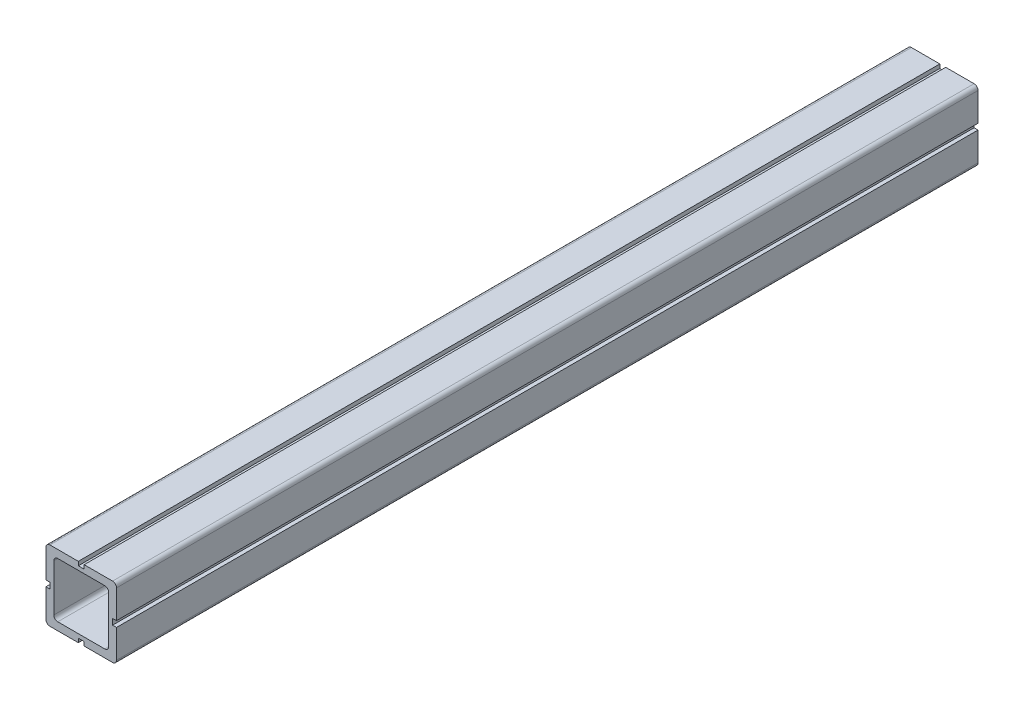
ISO-10303-21;
HEADER;
FILE_DESCRIPTION(('STEP AP214'),'2;1');
FILE_NAME('part.step','',(''),(''),'','','');
FILE_SCHEMA(('AUTOMOTIVE_DESIGN { 1 0 10303 214 1 1 1 1 }'));
ENDSEC;
DATA;
#1=APPLICATION_CONTEXT('core data for automotive mechanical design processes');
#2=APPLICATION_PROTOCOL_DEFINITION('international standard','automotive_design',2000,#1);
#3=PRODUCT_CONTEXT('',#1,'mechanical');
#4=PRODUCT('Part','Part','',(#3));
#5=PRODUCT_RELATED_PRODUCT_CATEGORY('part','',(#4));
#6=PRODUCT_DEFINITION_FORMATION('','',#4);
#7=PRODUCT_DEFINITION_CONTEXT('part definition',#1,'design');
#8=PRODUCT_DEFINITION('design','',#6,#7);
#9=PRODUCT_DEFINITION_SHAPE('','',#8);
#10=(LENGTH_UNIT() NAMED_UNIT(*) SI_UNIT(.MILLI.,.METRE.));
#11=(NAMED_UNIT(*) PLANE_ANGLE_UNIT() SI_UNIT($,.RADIAN.));
#12=(NAMED_UNIT(*) SI_UNIT($,.STERADIAN.) SOLID_ANGLE_UNIT());
#13=UNCERTAINTY_MEASURE_WITH_UNIT(LENGTH_MEASURE(1.E-05),#10,'distance_accuracy_value','');
#14=(GEOMETRIC_REPRESENTATION_CONTEXT(3) GLOBAL_UNCERTAINTY_ASSIGNED_CONTEXT((#13)) GLOBAL_UNIT_ASSIGNED_CONTEXT((#10,
#11,#12)) REPRESENTATION_CONTEXT('',''));
#15=CARTESIAN_POINT('',(0.,0.,0.));
#16=DIRECTION('',(0.,0.,1.));
#17=DIRECTION('',(1.,0.,0.));
#18=AXIS2_PLACEMENT_3D('',#15,#16,#17);
#19=CARTESIAN_POINT('',(-9.,9.,110.));
#20=DIRECTION('',(1.,0.,0.));
#21=DIRECTION('',(0.,0.,-1.));
#22=AXIS2_PLACEMENT_3D('',#19,#20,#21);
#23=PLANE('',#22);
#24=DIRECTION('',(0.,-1.,0.));
#25=VECTOR('',#24,1.);
#26=CARTESIAN_POINT('',(-9.,9.,110.));
#27=LINE('',#26,#25);
#28=CARTESIAN_POINT('',(-9.,-0.750000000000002,110.));
#29=VERTEX_POINT('',#28);
#30=CARTESIAN_POINT('',(-9.,-8.,110.));
#31=VERTEX_POINT('',#30);
#32=EDGE_CURVE('E270',#29,#31,#27,.T.);
#33=ORIENTED_EDGE('',*,*,#32,.F.);
#34=DIRECTION('',(0.,0.,1.));
#35=VECTOR('',#34,1.);
#36=CARTESIAN_POINT('',(-9.,-0.750000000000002,-110.001));
#37=LINE('',#36,#35);
#38=CARTESIAN_POINT('',(-9.,-0.750000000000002,-110.));
#39=VERTEX_POINT('',#38);
#40=EDGE_CURVE('E492',#39,#29,#37,.T.);
#41=ORIENTED_EDGE('',*,*,#40,.F.);
#42=DIRECTION('',(0.,-1.,0.));
#43=VECTOR('',#42,1.);
#44=CARTESIAN_POINT('',(-9.,9.,-110.));
#45=LINE('',#44,#43);
#46=CARTESIAN_POINT('',(-9.,-8.,-110.));
#47=VERTEX_POINT('',#46);
#48=EDGE_CURVE('E391',#39,#47,#45,.T.);
#49=ORIENTED_EDGE('',*,*,#48,.T.);
#50=DIRECTION('',(0.,0.,-1.));
#51=VECTOR('',#50,1.);
#52=CARTESIAN_POINT('',(-9.,-8.,110.));
#53=LINE('',#52,#51);
#54=EDGE_CURVE('E338',#47,#31,#53,.F.);
#55=ORIENTED_EDGE('',*,*,#54,.T.);
#56=EDGE_LOOP('',(#33,#41,#49,#55));
#57=FACE_BOUND('',#56,.T.);
#58=ADVANCED_FACE('F34',(#57),#23,.F.);
#59=CARTESIAN_POINT('',(9.,-9.,110.));
#60=DIRECTION('',(0.,1.,0.));
#61=DIRECTION('',(0.,0.,1.));
#62=AXIS2_PLACEMENT_3D('',#59,#60,#61);
#63=PLANE('',#62);
#64=DIRECTION('',(1.,0.,0.));
#65=VECTOR('',#64,1.);
#66=CARTESIAN_POINT('',(9.,-9.,110.));
#67=LINE('',#66,#65);
#68=CARTESIAN_POINT('',(0.750000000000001,-9.,110.));
#69=VERTEX_POINT('',#68);
#70=CARTESIAN_POINT('',(8.,-9.,110.));
#71=VERTEX_POINT('',#70);
#72=EDGE_CURVE('E399',#69,#71,#67,.T.);
#73=ORIENTED_EDGE('',*,*,#72,.F.);
#74=DIRECTION('',(0.,0.,1.));
#75=VECTOR('',#74,1.);
#76=CARTESIAN_POINT('',(0.750000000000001,-9.,-110.001));
#77=LINE('',#76,#75);
#78=CARTESIAN_POINT('',(0.750000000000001,-9.,-110.));
#79=VERTEX_POINT('',#78);
#80=EDGE_CURVE('E424',#79,#69,#77,.T.);
#81=ORIENTED_EDGE('',*,*,#80,.F.);
#82=DIRECTION('',(1.,0.,0.));
#83=VECTOR('',#82,1.);
#84=CARTESIAN_POINT('',(9.,-9.,-110.));
#85=LINE('',#84,#83);
#86=CARTESIAN_POINT('',(8.,-9.,-110.));
#87=VERTEX_POINT('',#86);
#88=EDGE_CURVE('E411',#79,#87,#85,.T.);
#89=ORIENTED_EDGE('',*,*,#88,.T.);
#90=DIRECTION('',(0.,0.,-1.));
#91=VECTOR('',#90,1.);
#92=CARTESIAN_POINT('',(8.,-9.,110.));
#93=LINE('',#92,#91);
#94=EDGE_CURVE('E332',#87,#71,#93,.F.);
#95=ORIENTED_EDGE('',*,*,#94,.T.);
#96=EDGE_LOOP('',(#73,#81,#89,#95));
#97=FACE_BOUND('',#96,.T.);
#98=ADVANCED_FACE('F421',(#97),#63,.F.);
#99=CARTESIAN_POINT('',(9.,9.,110.));
#100=DIRECTION('',(-1.,0.,0.));
#101=DIRECTION('',(0.,0.,1.));
#102=AXIS2_PLACEMENT_3D('',#99,#100,#101);
#103=PLANE('',#102);
#104=DIRECTION('',(0.,1.,0.));
#105=VECTOR('',#104,1.);
#106=CARTESIAN_POINT('',(9.,9.,110.));
#107=LINE('',#106,#105);
#108=CARTESIAN_POINT('',(9.,0.750000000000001,110.));
#109=VERTEX_POINT('',#108);
#110=CARTESIAN_POINT('',(9.,8.,110.));
#111=VERTEX_POINT('',#110);
#112=EDGE_CURVE('E403',#109,#111,#107,.T.);
#113=ORIENTED_EDGE('',*,*,#112,.F.);
#114=DIRECTION('',(0.,0.,1.));
#115=VECTOR('',#114,1.);
#116=CARTESIAN_POINT('',(9.,0.750000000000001,-110.001));
#117=LINE('',#116,#115);
#118=CARTESIAN_POINT('',(9.,0.750000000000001,-110.));
#119=VERTEX_POINT('',#118);
#120=EDGE_CURVE('E442',#119,#109,#117,.T.);
#121=ORIENTED_EDGE('',*,*,#120,.F.);
#122=DIRECTION('',(0.,1.,0.));
#123=VECTOR('',#122,1.);
#124=CARTESIAN_POINT('',(9.,9.,-110.));
#125=LINE('',#124,#123);
#126=CARTESIAN_POINT('',(9.,8.,-110.));
#127=VERTEX_POINT('',#126);
#128=EDGE_CURVE('E414',#119,#127,#125,.T.);
#129=ORIENTED_EDGE('',*,*,#128,.T.);
#130=DIRECTION('',(0.,0.,-1.));
#131=VECTOR('',#130,1.);
#132=CARTESIAN_POINT('',(9.,8.,110.));
#133=LINE('',#132,#131);
#134=EDGE_CURVE('E318',#127,#111,#133,.F.);
#135=ORIENTED_EDGE('',*,*,#134,.T.);
#136=EDGE_LOOP('',(#113,#121,#129,#135));
#137=FACE_BOUND('',#136,.T.);
#138=ADVANCED_FACE('F561',(#137),#103,.F.);
#139=CARTESIAN_POINT('',(9.,9.,110.));
#140=DIRECTION('',(0.,-1.,0.));
#141=DIRECTION('',(0.,0.,-1.));
#142=AXIS2_PLACEMENT_3D('',#139,#140,#141);
#143=PLANE('',#142);
#144=DIRECTION('',(-1.,0.,0.));
#145=VECTOR('',#144,1.);
#146=CARTESIAN_POINT('',(9.,9.,110.));
#147=LINE('',#146,#145);
#148=CARTESIAN_POINT('',(-0.75,9.,110.));
#149=VERTEX_POINT('',#148);
#150=CARTESIAN_POINT('',(-8.,9.,110.));
#151=VERTEX_POINT('',#150);
#152=EDGE_CURVE('E407',#149,#151,#147,.T.);
#153=ORIENTED_EDGE('',*,*,#152,.F.);
#154=DIRECTION('',(0.,0.,1.));
#155=VECTOR('',#154,1.);
#156=CARTESIAN_POINT('',(-0.75,9.,-110.001));
#157=LINE('',#156,#155);
#158=CARTESIAN_POINT('',(-0.750000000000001,9.,-110.));
#159=VERTEX_POINT('',#158);
#160=EDGE_CURVE('E252',#159,#149,#157,.T.);
#161=ORIENTED_EDGE('',*,*,#160,.F.);
#162=DIRECTION('',(-1.,0.,0.));
#163=VECTOR('',#162,1.);
#164=CARTESIAN_POINT('',(9.,9.,-110.));
#165=LINE('',#164,#163);
#166=CARTESIAN_POINT('',(-8.,9.,-110.));
#167=VERTEX_POINT('',#166);
#168=EDGE_CURVE('E271',#159,#167,#165,.T.);
#169=ORIENTED_EDGE('',*,*,#168,.T.);
#170=DIRECTION('',(0.,0.,-1.));
#171=VECTOR('',#170,1.);
#172=CARTESIAN_POINT('',(-8.,9.,110.));
#173=LINE('',#172,#171);
#174=EDGE_CURVE('E300',#167,#151,#173,.F.);
#175=ORIENTED_EDGE('',*,*,#174,.T.);
#176=EDGE_LOOP('',(#153,#161,#169,#175));
#177=FACE_BOUND('',#176,.T.);
#178=ADVANCED_FACE('F534',(#177),#143,.F.);
#179=CARTESIAN_POINT('',(0.,0.,110.));
#180=DIRECTION('',(0.,0.,-1.));
#181=DIRECTION('',(-1.,0.,0.));
#182=AXIS2_PLACEMENT_3D('',#179,#180,#181);
#183=PLANE('',#182);
#184=DIRECTION('',(1.,0.,0.));
#185=VECTOR('',#184,1.);
#186=CARTESIAN_POINT('',(0.75,7.99999999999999,110.));
#187=LINE('',#186,#185);
#188=CARTESIAN_POINT('',(-0.75,7.99999999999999,110.));
#189=VERTEX_POINT('',#188);
#190=CARTESIAN_POINT('',(0.75,7.99999999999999,110.));
#191=VERTEX_POINT('',#190);
#192=EDGE_CURVE('E543',#189,#191,#187,.T.);
#193=ORIENTED_EDGE('',*,*,#192,.F.);
#194=DIRECTION('',(0.,-1.,0.));
#195=VECTOR('',#194,1.);
#196=CARTESIAN_POINT('',(-0.75,9.99999999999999,110.));
#197=LINE('',#196,#195);
#198=EDGE_CURVE('E541',#149,#189,#197,.T.);
#199=ORIENTED_EDGE('',*,*,#198,.F.);
#200=ORIENTED_EDGE('',*,*,#152,.T.);
#201=CARTESIAN_POINT('',(-8.,8.,110.));
#202=DIRECTION('',(0.,0.,-1.));
#203=DIRECTION('',(-1.,0.,0.));
#204=AXIS2_PLACEMENT_3D('',#201,#202,#203);
#205=CIRCLE('',#204,1.);
#206=CARTESIAN_POINT('',(-9.,8.,110.));
#207=VERTEX_POINT('',#206);
#208=EDGE_CURVE('E321',#151,#207,#205,.F.);
#209=ORIENTED_EDGE('',*,*,#208,.T.);
#210=CARTESIAN_POINT('',(-9.,0.749999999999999,110.));
#211=VERTEX_POINT('',#210);
#212=EDGE_CURVE('E273',#207,#211,#27,.T.);
#213=ORIENTED_EDGE('',*,*,#212,.T.);
#214=DIRECTION('',(-1.,0.,0.));
#215=VECTOR('',#214,1.);
#216=CARTESIAN_POINT('',(-9.99999999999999,0.749999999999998,110.));
#217=LINE('',#216,#215);
#218=CARTESIAN_POINT('',(-7.99999999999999,0.749999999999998,110.));
#219=VERTEX_POINT('',#218);
#220=EDGE_CURVE('E49',#219,#211,#217,.T.);
#221=ORIENTED_EDGE('',*,*,#220,.F.);
#222=DIRECTION('',(0.,1.,0.));
#223=VECTOR('',#222,1.);
#224=CARTESIAN_POINT('',(-7.99999999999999,0.749999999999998,110.));
#225=LINE('',#224,#223);
#226=CARTESIAN_POINT('',(-7.99999999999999,-0.750000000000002,110.));
#227=VERTEX_POINT('',#226);
#228=EDGE_CURVE('E503',#227,#219,#225,.T.);
#229=ORIENTED_EDGE('',*,*,#228,.F.);
#230=DIRECTION('',(1.,0.,0.));
#231=VECTOR('',#230,1.);
#232=CARTESIAN_POINT('',(-9.99999999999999,-0.750000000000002,110.));
#233=LINE('',#232,#231);
#234=EDGE_CURVE('E500',#29,#227,#233,.T.);
#235=ORIENTED_EDGE('',*,*,#234,.F.);
#236=ORIENTED_EDGE('',*,*,#32,.T.);
#237=CARTESIAN_POINT('',(-8.,-8.,110.));
#238=DIRECTION('',(0.,0.,-1.));
#239=DIRECTION('',(-1.,0.,0.));
#240=AXIS2_PLACEMENT_3D('',#237,#238,#239);
#241=CIRCLE('',#240,1.);
#242=CARTESIAN_POINT('',(-8.,-9.,110.));
#243=VERTEX_POINT('',#242);
#244=EDGE_CURVE('E323',#31,#243,#241,.F.);
#245=ORIENTED_EDGE('',*,*,#244,.T.);
#246=CARTESIAN_POINT('',(-0.749999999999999,-9.,110.));
#247=VERTEX_POINT('',#246);
#248=EDGE_CURVE('E400',#243,#247,#67,.T.);
#249=ORIENTED_EDGE('',*,*,#248,.T.);
#250=DIRECTION('',(0.,-1.,0.));
#251=VECTOR('',#250,1.);
#252=CARTESIAN_POINT('',(-0.749999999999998,-9.99999999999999,110.));
#253=LINE('',#252,#251);
#254=CARTESIAN_POINT('',(-0.749999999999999,-7.99999999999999,110.));
#255=VERTEX_POINT('',#254);
#256=EDGE_CURVE('E57',#255,#247,#253,.T.);
#257=ORIENTED_EDGE('',*,*,#256,.F.);
#258=DIRECTION('',(-1.,0.,0.));
#259=VECTOR('',#258,1.);
#260=CARTESIAN_POINT('',(-0.749999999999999,-7.99999999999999,110.));
#261=LINE('',#260,#259);
#262=CARTESIAN_POINT('',(0.750000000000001,-7.99999999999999,110.));
#263=VERTEX_POINT('',#262);
#264=EDGE_CURVE('E483',#263,#255,#261,.T.);
#265=ORIENTED_EDGE('',*,*,#264,.F.);
#266=DIRECTION('',(0.,1.,0.));
#267=VECTOR('',#266,1.);
#268=CARTESIAN_POINT('',(0.750000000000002,-9.99999999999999,110.));
#269=LINE('',#268,#267);
#270=EDGE_CURVE('E480',#69,#263,#269,.T.);
#271=ORIENTED_EDGE('',*,*,#270,.F.);
#272=ORIENTED_EDGE('',*,*,#72,.T.);
#273=CARTESIAN_POINT('',(8.,-8.,110.));
#274=DIRECTION('',(0.,0.,-1.));
#275=DIRECTION('',(-1.,0.,0.));
#276=AXIS2_PLACEMENT_3D('',#273,#274,#275);
#277=CIRCLE('',#276,1.);
#278=CARTESIAN_POINT('',(9.,-8.,110.));
#279=VERTEX_POINT('',#278);
#280=EDGE_CURVE('E325',#71,#279,#277,.F.);
#281=ORIENTED_EDGE('',*,*,#280,.T.);
#282=CARTESIAN_POINT('',(9.,-0.749999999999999,110.));
#283=VERTEX_POINT('',#282);
#284=EDGE_CURVE('E404',#279,#283,#107,.T.);
#285=ORIENTED_EDGE('',*,*,#284,.T.);
#286=DIRECTION('',(1.,0.,0.));
#287=VECTOR('',#286,1.);
#288=CARTESIAN_POINT('',(9.99999999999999,-0.749999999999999,110.));
#289=LINE('',#288,#287);
#290=CARTESIAN_POINT('',(7.99999999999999,-0.749999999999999,110.));
#291=VERTEX_POINT('',#290);
#292=EDGE_CURVE('E463',#291,#283,#289,.T.);
#293=ORIENTED_EDGE('',*,*,#292,.F.);
#294=DIRECTION('',(0.,-1.,0.));
#295=VECTOR('',#294,1.);
#296=CARTESIAN_POINT('',(7.99999999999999,-0.749999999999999,110.));
#297=LINE('',#296,#295);
#298=CARTESIAN_POINT('',(7.99999999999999,0.750000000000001,110.));
#299=VERTEX_POINT('',#298);
#300=EDGE_CURVE('E460',#299,#291,#297,.T.);
#301=ORIENTED_EDGE('',*,*,#300,.F.);
#302=DIRECTION('',(-1.,0.,0.));
#303=VECTOR('',#302,1.);
#304=CARTESIAN_POINT('',(9.99999999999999,0.750000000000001,110.));
#305=LINE('',#304,#303);
#306=EDGE_CURVE('E457',#109,#299,#305,.T.);
#307=ORIENTED_EDGE('',*,*,#306,.F.);
#308=ORIENTED_EDGE('',*,*,#112,.T.);
#309=CARTESIAN_POINT('',(8.,8.,110.));
#310=DIRECTION('',(0.,0.,-1.));
#311=DIRECTION('',(-1.,0.,0.));
#312=AXIS2_PLACEMENT_3D('',#309,#310,#311);
#313=CIRCLE('',#312,1.);
#314=CARTESIAN_POINT('',(8.,9.,110.));
#315=VERTEX_POINT('',#314);
#316=EDGE_CURVE('E327',#111,#315,#313,.F.);
#317=ORIENTED_EDGE('',*,*,#316,.T.);
#318=CARTESIAN_POINT('',(0.749999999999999,9.,110.));
#319=VERTEX_POINT('',#318);
#320=EDGE_CURVE('E282',#315,#319,#147,.T.);
#321=ORIENTED_EDGE('',*,*,#320,.T.);
#322=DIRECTION('',(0.,1.,0.));
#323=VECTOR('',#322,1.);
#324=CARTESIAN_POINT('',(0.75,9.99999999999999,110.));
#325=LINE('',#324,#323);
#326=EDGE_CURVE('E247',#191,#319,#325,.T.);
#327=ORIENTED_EDGE('',*,*,#326,.F.);
#328=EDGE_LOOP('',(#193,#199,#200,#209,#213,#221,#229,#235,#236,#245,#249,#257,#265,#271,#272,
#281,#285,#293,#301,#307,#308,#317,#321,#327));
#329=FACE_BOUND('',#328,.T.);
#330=DIRECTION('',(0.,-1.,0.));
#331=VECTOR('',#330,1.);
#332=CARTESIAN_POINT('',(-7.,7.,110.));
#333=LINE('',#332,#331);
#334=CARTESIAN_POINT('',(-7.,6.,110.));
#335=VERTEX_POINT('',#334);
#336=CARTESIAN_POINT('',(-7.,-6.,110.));
#337=VERTEX_POINT('',#336);
#338=EDGE_CURVE('E381',#335,#337,#333,.T.);
#339=ORIENTED_EDGE('',*,*,#338,.F.);
#340=CARTESIAN_POINT('',(-6.,6.,110.));
#341=DIRECTION('',(0.,0.,-1.));
#342=DIRECTION('',(-1.,0.,0.));
#343=AXIS2_PLACEMENT_3D('',#340,#341,#342);
#344=CIRCLE('',#343,1.);
#345=CARTESIAN_POINT('',(-6.,7.,110.));
#346=VERTEX_POINT('',#345);
#347=EDGE_CURVE('E351',#335,#346,#344,.T.);
#348=ORIENTED_EDGE('',*,*,#347,.T.);
#349=DIRECTION('',(-1.,0.,0.));
#350=VECTOR('',#349,1.);
#351=CARTESIAN_POINT('',(7.,7.,110.));
#352=LINE('',#351,#350);
#353=CARTESIAN_POINT('',(6.,7.,110.));
#354=VERTEX_POINT('',#353);
#355=EDGE_CURVE('E383',#354,#346,#352,.T.);
#356=ORIENTED_EDGE('',*,*,#355,.F.);
#357=CARTESIAN_POINT('',(6.,6.,110.));
#358=DIRECTION('',(0.,0.,-1.));
#359=DIRECTION('',(-1.,0.,0.));
#360=AXIS2_PLACEMENT_3D('',#357,#358,#359);
#361=CIRCLE('',#360,1.);
#362=CARTESIAN_POINT('',(7.,6.,110.));
#363=VERTEX_POINT('',#362);
#364=EDGE_CURVE('E347',#354,#363,#361,.T.);
#365=ORIENTED_EDGE('',*,*,#364,.T.);
#366=DIRECTION('',(0.,1.,0.));
#367=VECTOR('',#366,1.);
#368=CARTESIAN_POINT('',(7.,7.,110.));
#369=LINE('',#368,#367);
#370=CARTESIAN_POINT('',(7.,-6.,110.));
#371=VERTEX_POINT('',#370);
#372=EDGE_CURVE('E377',#371,#363,#369,.T.);
#373=ORIENTED_EDGE('',*,*,#372,.F.);
#374=CARTESIAN_POINT('',(6.,-6.,110.));
#375=DIRECTION('',(0.,0.,-1.));
#376=DIRECTION('',(-1.,0.,0.));
#377=AXIS2_PLACEMENT_3D('',#374,#375,#376);
#378=CIRCLE('',#377,1.);
#379=CARTESIAN_POINT('',(6.,-7.,110.));
#380=VERTEX_POINT('',#379);
#381=EDGE_CURVE('E11',#371,#380,#378,.T.);
#382=ORIENTED_EDGE('',*,*,#381,.T.);
#383=DIRECTION('',(1.,0.,0.));
#384=VECTOR('',#383,1.);
#385=CARTESIAN_POINT('',(7.,-7.,110.));
#386=LINE('',#385,#384);
#387=CARTESIAN_POINT('',(-6.,-7.,110.));
#388=VERTEX_POINT('',#387);
#389=EDGE_CURVE('E375',#388,#380,#386,.T.);
#390=ORIENTED_EDGE('',*,*,#389,.F.);
#391=CARTESIAN_POINT('',(-6.,-6.,110.));
#392=DIRECTION('',(0.,0.,-1.));
#393=DIRECTION('',(-1.,0.,0.));
#394=AXIS2_PLACEMENT_3D('',#391,#392,#393);
#395=CIRCLE('',#394,1.);
#396=EDGE_CURVE('E343',#388,#337,#395,.T.);
#397=ORIENTED_EDGE('',*,*,#396,.T.);
#398=EDGE_LOOP('',(#339,#348,#356,#365,#373,#382,#390,#397));
#399=FACE_BOUND('',#398,.T.);
#400=ADVANCED_FACE('F374',(#329,#399),#183,.F.);
#401=CARTESIAN_POINT('',(0.,0.,-110.));
#402=DIRECTION('',(0.,0.,-1.));
#403=DIRECTION('',(-1.,0.,0.));
#404=AXIS2_PLACEMENT_3D('',#401,#402,#403);
#405=PLANE('',#404);
#406=DIRECTION('',(0.,-1.,0.));
#407=VECTOR('',#406,1.);
#408=CARTESIAN_POINT('',(-0.75,9.99999999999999,-110.));
#409=LINE('',#408,#407);
#410=CARTESIAN_POINT('',(-0.75,7.99999999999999,-110.));
#411=VERTEX_POINT('',#410);
#412=EDGE_CURVE('E264',#159,#411,#409,.T.);
#413=ORIENTED_EDGE('',*,*,#412,.T.);
#414=DIRECTION('',(1.,0.,0.));
#415=VECTOR('',#414,1.);
#416=CARTESIAN_POINT('',(0.75,7.99999999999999,-110.));
#417=LINE('',#416,#415);
#418=CARTESIAN_POINT('',(0.75,7.99999999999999,-110.));
#419=VERTEX_POINT('',#418);
#420=EDGE_CURVE('E263',#411,#419,#417,.T.);
#421=ORIENTED_EDGE('',*,*,#420,.T.);
#422=DIRECTION('',(0.,1.,0.));
#423=VECTOR('',#422,1.);
#424=CARTESIAN_POINT('',(0.75,9.99999999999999,-110.));
#425=LINE('',#424,#423);
#426=CARTESIAN_POINT('',(0.749999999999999,9.,-110.));
#427=VERTEX_POINT('',#426);
#428=EDGE_CURVE('E244',#419,#427,#425,.T.);
#429=ORIENTED_EDGE('',*,*,#428,.T.);
#430=CARTESIAN_POINT('',(8.,9.,-110.));
#431=VERTEX_POINT('',#430);
#432=EDGE_CURVE('E262',#431,#427,#165,.T.);
#433=ORIENTED_EDGE('',*,*,#432,.F.);
#434=CARTESIAN_POINT('',(8.,8.,-110.));
#435=DIRECTION('',(0.,0.,-1.));
#436=DIRECTION('',(-1.,0.,0.));
#437=AXIS2_PLACEMENT_3D('',#434,#435,#436);
#438=CIRCLE('',#437,1.);
#439=EDGE_CURVE('E313',#431,#127,#438,.T.);
#440=ORIENTED_EDGE('',*,*,#439,.T.);
#441=ORIENTED_EDGE('',*,*,#128,.F.);
#442=DIRECTION('',(-1.,0.,0.));
#443=VECTOR('',#442,1.);
#444=CARTESIAN_POINT('',(9.99999999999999,0.750000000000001,-110.));
#445=LINE('',#444,#443);
#446=CARTESIAN_POINT('',(7.99999999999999,0.750000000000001,-110.));
#447=VERTEX_POINT('',#446);
#448=EDGE_CURVE('E454',#119,#447,#445,.T.);
#449=ORIENTED_EDGE('',*,*,#448,.T.);
#450=DIRECTION('',(0.,-1.,0.));
#451=VECTOR('',#450,1.);
#452=CARTESIAN_POINT('',(7.99999999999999,-0.749999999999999,-110.));
#453=LINE('',#452,#451);
#454=CARTESIAN_POINT('',(7.99999999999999,-0.749999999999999,-110.));
#455=VERTEX_POINT('',#454);
#456=EDGE_CURVE('E253',#447,#455,#453,.T.);
#457=ORIENTED_EDGE('',*,*,#456,.T.);
#458=DIRECTION('',(1.,0.,0.));
#459=VECTOR('',#458,1.);
#460=CARTESIAN_POINT('',(9.99999999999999,-0.749999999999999,-110.));
#461=LINE('',#460,#459);
#462=CARTESIAN_POINT('',(9.,-0.749999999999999,-110.));
#463=VERTEX_POINT('',#462);
#464=EDGE_CURVE('E445',#455,#463,#461,.T.);
#465=ORIENTED_EDGE('',*,*,#464,.T.);
#466=CARTESIAN_POINT('',(9.,-8.,-110.));
#467=VERTEX_POINT('',#466);
#468=EDGE_CURVE('E275',#467,#463,#125,.T.);
#469=ORIENTED_EDGE('',*,*,#468,.F.);
#470=CARTESIAN_POINT('',(8.,-8.,-110.));
#471=DIRECTION('',(0.,0.,-1.));
#472=DIRECTION('',(-1.,0.,0.));
#473=AXIS2_PLACEMENT_3D('',#470,#471,#472);
#474=CIRCLE('',#473,1.);
#475=EDGE_CURVE('E310',#467,#87,#474,.T.);
#476=ORIENTED_EDGE('',*,*,#475,.T.);
#477=ORIENTED_EDGE('',*,*,#88,.F.);
#478=DIRECTION('',(0.,1.,0.));
#479=VECTOR('',#478,1.);
#480=CARTESIAN_POINT('',(0.750000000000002,-9.99999999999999,-110.));
#481=LINE('',#480,#479);
#482=CARTESIAN_POINT('',(0.750000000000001,-7.99999999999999,-110.));
#483=VERTEX_POINT('',#482);
#484=EDGE_CURVE('E478',#79,#483,#481,.T.);
#485=ORIENTED_EDGE('',*,*,#484,.T.);
#486=DIRECTION('',(-1.,0.,0.));
#487=VECTOR('',#486,1.);
#488=CARTESIAN_POINT('',(-0.749999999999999,-7.99999999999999,-110.));
#489=LINE('',#488,#487);
#490=CARTESIAN_POINT('',(-0.749999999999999,-7.99999999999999,-110.));
#491=VERTEX_POINT('',#490);
#492=EDGE_CURVE('E443',#483,#491,#489,.T.);
#493=ORIENTED_EDGE('',*,*,#492,.T.);
#494=DIRECTION('',(0.,-1.,0.));
#495=VECTOR('',#494,1.);
#496=CARTESIAN_POINT('',(-0.749999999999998,-9.99999999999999,-110.));
#497=LINE('',#496,#495);
#498=CARTESIAN_POINT('',(-0.749999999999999,-9.,-110.));
#499=VERTEX_POINT('',#498);
#500=EDGE_CURVE('E475',#491,#499,#497,.T.);
#501=ORIENTED_EDGE('',*,*,#500,.T.);
#502=CARTESIAN_POINT('',(-8.,-9.,-110.));
#503=VERTEX_POINT('',#502);
#504=EDGE_CURVE('E412',#503,#499,#85,.T.);
#505=ORIENTED_EDGE('',*,*,#504,.F.);
#506=CARTESIAN_POINT('',(-8.,-8.,-110.));
#507=DIRECTION('',(0.,0.,-1.));
#508=DIRECTION('',(-1.,0.,0.));
#509=AXIS2_PLACEMENT_3D('',#506,#507,#508);
#510=CIRCLE('',#509,1.);
#511=EDGE_CURVE('E307',#503,#47,#510,.T.);
#512=ORIENTED_EDGE('',*,*,#511,.T.);
#513=ORIENTED_EDGE('',*,*,#48,.F.);
#514=DIRECTION('',(1.,0.,0.));
#515=VECTOR('',#514,1.);
#516=CARTESIAN_POINT('',(-9.99999999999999,-0.750000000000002,-110.));
#517=LINE('',#516,#515);
#518=CARTESIAN_POINT('',(-7.99999999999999,-0.750000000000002,-110.));
#519=VERTEX_POINT('',#518);
#520=EDGE_CURVE('E497',#39,#519,#517,.T.);
#521=ORIENTED_EDGE('',*,*,#520,.T.);
#522=DIRECTION('',(0.,1.,0.));
#523=VECTOR('',#522,1.);
#524=CARTESIAN_POINT('',(-7.99999999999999,0.749999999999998,-110.));
#525=LINE('',#524,#523);
#526=CARTESIAN_POINT('',(-7.99999999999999,0.749999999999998,-110.));
#527=VERTEX_POINT('',#526);
#528=EDGE_CURVE('E473',#519,#527,#525,.T.);
#529=ORIENTED_EDGE('',*,*,#528,.T.);
#530=DIRECTION('',(-1.,0.,0.));
#531=VECTOR('',#530,1.);
#532=CARTESIAN_POINT('',(-9.99999999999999,0.749999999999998,-110.));
#533=LINE('',#532,#531);
#534=CARTESIAN_POINT('',(-9.,0.749999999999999,-110.));
#535=VERTEX_POINT('',#534);
#536=EDGE_CURVE('E494',#527,#535,#533,.T.);
#537=ORIENTED_EDGE('',*,*,#536,.T.);
#538=CARTESIAN_POINT('',(-9.,8.,-110.));
#539=VERTEX_POINT('',#538);
#540=EDGE_CURVE('E409',#539,#535,#45,.T.);
#541=ORIENTED_EDGE('',*,*,#540,.F.);
#542=CARTESIAN_POINT('',(-8.,8.,-110.));
#543=DIRECTION('',(0.,0.,-1.));
#544=DIRECTION('',(-1.,0.,0.));
#545=AXIS2_PLACEMENT_3D('',#542,#543,#544);
#546=CIRCLE('',#545,1.);
#547=EDGE_CURVE('E304',#539,#167,#546,.T.);
#548=ORIENTED_EDGE('',*,*,#547,.T.);
#549=ORIENTED_EDGE('',*,*,#168,.F.);
#550=EDGE_LOOP('',(#413,#421,#429,#433,#440,#441,#449,#457,#465,#469,#476,#477,#485,#493,#501,
#505,#512,#513,#521,#529,#537,#541,#548,#549));
#551=FACE_BOUND('',#550,.T.);
#552=DIRECTION('',(0.,1.,0.));
#553=VECTOR('',#552,1.);
#554=CARTESIAN_POINT('',(7.,7.,-110.));
#555=LINE('',#554,#553);
#556=CARTESIAN_POINT('',(7.,-6.,-110.));
#557=VERTEX_POINT('',#556);
#558=CARTESIAN_POINT('',(7.,6.,-110.));
#559=VERTEX_POINT('',#558);
#560=EDGE_CURVE('E355',#557,#559,#555,.T.);
#561=ORIENTED_EDGE('',*,*,#560,.T.);
#562=CARTESIAN_POINT('',(6.,6.,-110.));
#563=DIRECTION('',(0.,0.,-1.));
#564=DIRECTION('',(-1.,0.,0.));
#565=AXIS2_PLACEMENT_3D('',#562,#563,#564);
#566=CIRCLE('',#565,1.);
#567=CARTESIAN_POINT('',(6.,7.,-110.));
#568=VERTEX_POINT('',#567);
#569=EDGE_CURVE('E345',#559,#568,#566,.F.);
#570=ORIENTED_EDGE('',*,*,#569,.T.);
#571=DIRECTION('',(-1.,0.,0.));
#572=VECTOR('',#571,1.);
#573=CARTESIAN_POINT('',(7.,7.,-110.));
#574=LINE('',#573,#572);
#575=CARTESIAN_POINT('',(-6.,7.,-110.));
#576=VERTEX_POINT('',#575);
#577=EDGE_CURVE('E366',#568,#576,#574,.T.);
#578=ORIENTED_EDGE('',*,*,#577,.T.);
#579=CARTESIAN_POINT('',(-6.,6.,-110.));
#580=DIRECTION('',(0.,0.,-1.));
#581=DIRECTION('',(-1.,0.,0.));
#582=AXIS2_PLACEMENT_3D('',#579,#580,#581);
#583=CIRCLE('',#582,1.);
#584=CARTESIAN_POINT('',(-7.,6.,-110.));
#585=VERTEX_POINT('',#584);
#586=EDGE_CURVE('E349',#576,#585,#583,.F.);
#587=ORIENTED_EDGE('',*,*,#586,.T.);
#588=DIRECTION('',(0.,-1.,0.));
#589=VECTOR('',#588,1.);
#590=CARTESIAN_POINT('',(-7.,7.,-110.));
#591=LINE('',#590,#589);
#592=CARTESIAN_POINT('',(-7.,-6.,-110.));
#593=VERTEX_POINT('',#592);
#594=EDGE_CURVE('E392',#585,#593,#591,.T.);
#595=ORIENTED_EDGE('',*,*,#594,.T.);
#596=CARTESIAN_POINT('',(-6.,-6.,-110.));
#597=DIRECTION('',(0.,0.,-1.));
#598=DIRECTION('',(-1.,0.,0.));
#599=AXIS2_PLACEMENT_3D('',#596,#597,#598);
#600=CIRCLE('',#599,1.);
#601=CARTESIAN_POINT('',(-6.,-7.,-110.));
#602=VERTEX_POINT('',#601);
#603=EDGE_CURVE('E341',#593,#602,#600,.F.);
#604=ORIENTED_EDGE('',*,*,#603,.T.);
#605=DIRECTION('',(1.,0.,0.));
#606=VECTOR('',#605,1.);
#607=CARTESIAN_POINT('',(7.,-7.,-110.));
#608=LINE('',#607,#606);
#609=CARTESIAN_POINT('',(6.,-7.,-110.));
#610=VERTEX_POINT('',#609);
#611=EDGE_CURVE('E357',#602,#610,#608,.T.);
#612=ORIENTED_EDGE('',*,*,#611,.T.);
#613=CARTESIAN_POINT('',(6.,-6.,-110.));
#614=DIRECTION('',(0.,0.,-1.));
#615=DIRECTION('',(-1.,0.,0.));
#616=AXIS2_PLACEMENT_3D('',#613,#614,#615);
#617=CIRCLE('',#616,1.);
#618=EDGE_CURVE('E42',#610,#557,#617,.F.);
#619=ORIENTED_EDGE('',*,*,#618,.T.);
#620=EDGE_LOOP('',(#561,#570,#578,#587,#595,#604,#612,#619));
#621=FACE_BOUND('',#620,.T.);
#622=ADVANCED_FACE('F259',(#551,#621),#405,.T.);
#623=ORIENTED_EDGE('',*,*,#540,.T.);
#624=DIRECTION('',(0.,0.,-1.));
#625=VECTOR('',#624,1.);
#626=CARTESIAN_POINT('',(-9.,0.749999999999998,-110.001));
#627=LINE('',#626,#625);
#628=EDGE_CURVE('E490',#211,#535,#627,.T.);
#629=ORIENTED_EDGE('',*,*,#628,.F.);
#630=ORIENTED_EDGE('',*,*,#212,.F.);
#631=DIRECTION('',(0.,0.,-1.));
#632=VECTOR('',#631,1.);
#633=CARTESIAN_POINT('',(-9.,8.,110.));
#634=LINE('',#633,#632);
#635=EDGE_CURVE('E335',#207,#539,#634,.T.);
#636=ORIENTED_EDGE('',*,*,#635,.T.);
#637=EDGE_LOOP('',(#623,#629,#630,#636));
#638=FACE_BOUND('',#637,.T.);
#639=ADVANCED_FACE('F527',(#638),#23,.F.);
#640=ORIENTED_EDGE('',*,*,#504,.T.);
#641=DIRECTION('',(0.,0.,-1.));
#642=VECTOR('',#641,1.);
#643=CARTESIAN_POINT('',(-0.749999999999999,-9.,-110.001));
#644=LINE('',#643,#642);
#645=EDGE_CURVE('E471',#247,#499,#644,.T.);
#646=ORIENTED_EDGE('',*,*,#645,.F.);
#647=ORIENTED_EDGE('',*,*,#248,.F.);
#648=DIRECTION('',(0.,0.,-1.));
#649=VECTOR('',#648,1.);
#650=CARTESIAN_POINT('',(-8.,-9.,110.));
#651=LINE('',#650,#649);
#652=EDGE_CURVE('E329',#243,#503,#651,.T.);
#653=ORIENTED_EDGE('',*,*,#652,.T.);
#654=EDGE_LOOP('',(#640,#646,#647,#653));
#655=FACE_BOUND('',#654,.T.);
#656=ADVANCED_FACE('F588',(#655),#63,.F.);
#657=ORIENTED_EDGE('',*,*,#468,.T.);
#658=DIRECTION('',(0.,0.,-1.));
#659=VECTOR('',#658,1.);
#660=CARTESIAN_POINT('',(9.,-0.749999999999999,-110.001));
#661=LINE('',#660,#659);
#662=EDGE_CURVE('E440',#283,#463,#661,.T.);
#663=ORIENTED_EDGE('',*,*,#662,.F.);
#664=ORIENTED_EDGE('',*,*,#284,.F.);
#665=DIRECTION('',(0.,0.,-1.));
#666=VECTOR('',#665,1.);
#667=CARTESIAN_POINT('',(9.,-8.,110.));
#668=LINE('',#667,#666);
#669=EDGE_CURVE('E315',#279,#467,#668,.T.);
#670=ORIENTED_EDGE('',*,*,#669,.T.);
#671=EDGE_LOOP('',(#657,#663,#664,#670));
#672=FACE_BOUND('',#671,.T.);
#673=ADVANCED_FACE('F439',(#672),#103,.F.);
#674=ORIENTED_EDGE('',*,*,#432,.T.);
#675=DIRECTION('',(0.,0.,-1.));
#676=VECTOR('',#675,1.);
#677=CARTESIAN_POINT('',(0.75,9.,-110.001));
#678=LINE('',#677,#676);
#679=EDGE_CURVE('E241',#319,#427,#678,.T.);
#680=ORIENTED_EDGE('',*,*,#679,.F.);
#681=ORIENTED_EDGE('',*,*,#320,.F.);
#682=DIRECTION('',(0.,0.,-1.));
#683=VECTOR('',#682,1.);
#684=CARTESIAN_POINT('',(8.,9.,110.));
#685=LINE('',#684,#683);
#686=EDGE_CURVE('E269',#315,#431,#685,.T.);
#687=ORIENTED_EDGE('',*,*,#686,.T.);
#688=EDGE_LOOP('',(#674,#680,#681,#687));
#689=FACE_BOUND('',#688,.T.);
#690=ADVANCED_FACE('F267',(#689),#143,.F.);
#691=CARTESIAN_POINT('',(-7.,7.,110.));
#692=DIRECTION('',(1.,0.,0.));
#693=DIRECTION('',(0.,0.,-1.));
#694=AXIS2_PLACEMENT_3D('',#691,#692,#693);
#695=PLANE('',#694);
#696=ORIENTED_EDGE('',*,*,#338,.T.);
#697=DIRECTION('',(0.,0.,-1.));
#698=VECTOR('',#697,1.);
#699=CARTESIAN_POINT('',(-7.,-6.,-110.));
#700=LINE('',#699,#698);
#701=EDGE_CURVE('E281',#337,#593,#700,.T.);
#702=ORIENTED_EDGE('',*,*,#701,.T.);
#703=ORIENTED_EDGE('',*,*,#594,.F.);
#704=DIRECTION('',(0.,0.,-1.));
#705=VECTOR('',#704,1.);
#706=CARTESIAN_POINT('',(-7.,6.,110.));
#707=LINE('',#706,#705);
#708=EDGE_CURVE('E279',#585,#335,#707,.F.);
#709=ORIENTED_EDGE('',*,*,#708,.T.);
#710=EDGE_LOOP('',(#696,#702,#703,#709));
#711=FACE_BOUND('',#710,.T.);
#712=ADVANCED_FACE('F604',(#711),#695,.T.);
#713=CARTESIAN_POINT('',(7.,-7.,110.));
#714=DIRECTION('',(0.,1.,0.));
#715=DIRECTION('',(0.,0.,1.));
#716=AXIS2_PLACEMENT_3D('',#713,#714,#715);
#717=PLANE('',#716);
#718=ORIENTED_EDGE('',*,*,#611,.F.);
#719=DIRECTION('',(0.,0.,-1.));
#720=VECTOR('',#719,1.);
#721=CARTESIAN_POINT('',(-6.,-7.,110.));
#722=LINE('',#721,#720);
#723=EDGE_CURVE('E288',#602,#388,#722,.F.);
#724=ORIENTED_EDGE('',*,*,#723,.T.);
#725=ORIENTED_EDGE('',*,*,#389,.T.);
#726=DIRECTION('',(0.,0.,-1.));
#727=VECTOR('',#726,1.);
#728=CARTESIAN_POINT('',(6.,-7.,-110.));
#729=LINE('',#728,#727);
#730=EDGE_CURVE('E285',#380,#610,#729,.T.);
#731=ORIENTED_EDGE('',*,*,#730,.T.);
#732=EDGE_LOOP('',(#718,#724,#725,#731));
#733=FACE_BOUND('',#732,.T.);
#734=ADVANCED_FACE('F379',(#733),#717,.T.);
#735=CARTESIAN_POINT('',(7.,7.,110.));
#736=DIRECTION('',(-1.,0.,0.));
#737=DIRECTION('',(0.,0.,1.));
#738=AXIS2_PLACEMENT_3D('',#735,#736,#737);
#739=PLANE('',#738);
#740=ORIENTED_EDGE('',*,*,#372,.T.);
#741=DIRECTION('',(0.,0.,-1.));
#742=VECTOR('',#741,1.);
#743=CARTESIAN_POINT('',(7.,6.,-110.));
#744=LINE('',#743,#742);
#745=EDGE_CURVE('E292',#363,#559,#744,.T.);
#746=ORIENTED_EDGE('',*,*,#745,.T.);
#747=ORIENTED_EDGE('',*,*,#560,.F.);
#748=DIRECTION('',(0.,0.,-1.));
#749=VECTOR('',#748,1.);
#750=CARTESIAN_POINT('',(7.,-6.,110.));
#751=LINE('',#750,#749);
#752=EDGE_CURVE('E290',#557,#371,#751,.F.);
#753=ORIENTED_EDGE('',*,*,#752,.T.);
#754=EDGE_LOOP('',(#740,#746,#747,#753));
#755=FACE_BOUND('',#754,.T.);
#756=ADVANCED_FACE('F363',(#755),#739,.T.);
#757=CARTESIAN_POINT('',(7.,7.,110.));
#758=DIRECTION('',(0.,-1.,0.));
#759=DIRECTION('',(0.,0.,-1.));
#760=AXIS2_PLACEMENT_3D('',#757,#758,#759);
#761=PLANE('',#760);
#762=ORIENTED_EDGE('',*,*,#577,.F.);
#763=DIRECTION('',(0.,0.,-1.));
#764=VECTOR('',#763,1.);
#765=CARTESIAN_POINT('',(6.,7.,110.));
#766=LINE('',#765,#764);
#767=EDGE_CURVE('E298',#568,#354,#766,.F.);
#768=ORIENTED_EDGE('',*,*,#767,.T.);
#769=ORIENTED_EDGE('',*,*,#355,.T.);
#770=DIRECTION('',(0.,0.,-1.));
#771=VECTOR('',#770,1.);
#772=CARTESIAN_POINT('',(-6.,7.,-110.));
#773=LINE('',#772,#771);
#774=EDGE_CURVE('E295',#346,#576,#773,.T.);
#775=ORIENTED_EDGE('',*,*,#774,.T.);
#776=EDGE_LOOP('',(#762,#768,#769,#775));
#777=FACE_BOUND('',#776,.T.);
#778=ADVANCED_FACE('F743',(#777),#761,.T.);
#779=CARTESIAN_POINT('',(-6.,-6.,110.));
#780=DIRECTION('',(0.,0.,1.));
#781=DIRECTION('',(1.,0.,0.));
#782=AXIS2_PLACEMENT_3D('',#779,#780,#781);
#783=CYLINDRICAL_SURFACE('',#782,1.);
#784=ORIENTED_EDGE('',*,*,#396,.F.);
#785=ORIENTED_EDGE('',*,*,#723,.F.);
#786=ORIENTED_EDGE('',*,*,#603,.F.);
#787=ORIENTED_EDGE('',*,*,#701,.F.);
#788=EDGE_LOOP('',(#784,#785,#786,#787));
#789=FACE_BOUND('',#788,.T.);
#790=ADVANCED_FACE('F746',(#789),#783,.F.);
#791=CARTESIAN_POINT('',(6.,6.,110.));
#792=DIRECTION('',(0.,0.,1.));
#793=DIRECTION('',(1.,0.,0.));
#794=AXIS2_PLACEMENT_3D('',#791,#792,#793);
#795=CYLINDRICAL_SURFACE('',#794,1.);
#796=ORIENTED_EDGE('',*,*,#364,.F.);
#797=ORIENTED_EDGE('',*,*,#767,.F.);
#798=ORIENTED_EDGE('',*,*,#569,.F.);
#799=ORIENTED_EDGE('',*,*,#745,.F.);
#800=EDGE_LOOP('',(#796,#797,#798,#799));
#801=FACE_BOUND('',#800,.T.);
#802=ADVANCED_FACE('F767',(#801),#795,.F.);
#803=CARTESIAN_POINT('',(-6.,6.,110.));
#804=DIRECTION('',(0.,0.,1.));
#805=DIRECTION('',(1.,0.,0.));
#806=AXIS2_PLACEMENT_3D('',#803,#804,#805);
#807=CYLINDRICAL_SURFACE('',#806,1.);
#808=ORIENTED_EDGE('',*,*,#347,.F.);
#809=ORIENTED_EDGE('',*,*,#708,.F.);
#810=ORIENTED_EDGE('',*,*,#586,.F.);
#811=ORIENTED_EDGE('',*,*,#774,.F.);
#812=EDGE_LOOP('',(#808,#809,#810,#811));
#813=FACE_BOUND('',#812,.T.);
#814=ADVANCED_FACE('F760',(#813),#807,.F.);
#815=CARTESIAN_POINT('',(6.,-6.,110.));
#816=DIRECTION('',(0.,0.,1.));
#817=DIRECTION('',(1.,0.,0.));
#818=AXIS2_PLACEMENT_3D('',#815,#816,#817);
#819=CYLINDRICAL_SURFACE('',#818,1.);
#820=ORIENTED_EDGE('',*,*,#381,.F.);
#821=ORIENTED_EDGE('',*,*,#752,.F.);
#822=ORIENTED_EDGE('',*,*,#618,.F.);
#823=ORIENTED_EDGE('',*,*,#730,.F.);
#824=EDGE_LOOP('',(#820,#821,#822,#823));
#825=FACE_BOUND('',#824,.T.);
#826=ADVANCED_FACE('F369',(#825),#819,.F.);
#827=CARTESIAN_POINT('',(8.,8.,110.));
#828=DIRECTION('',(0.,0.,-1.));
#829=DIRECTION('',(-1.,0.,0.));
#830=AXIS2_PLACEMENT_3D('',#827,#828,#829);
#831=CYLINDRICAL_SURFACE('',#830,1.);
#832=ORIENTED_EDGE('',*,*,#316,.F.);
#833=ORIENTED_EDGE('',*,*,#134,.F.);
#834=ORIENTED_EDGE('',*,*,#439,.F.);
#835=ORIENTED_EDGE('',*,*,#686,.F.);
#836=EDGE_LOOP('',(#832,#833,#834,#835));
#837=FACE_BOUND('',#836,.T.);
#838=ADVANCED_FACE('F555',(#837),#831,.T.);
#839=CARTESIAN_POINT('',(8.,-8.,110.));
#840=DIRECTION('',(0.,0.,-1.));
#841=DIRECTION('',(-1.,0.,0.));
#842=AXIS2_PLACEMENT_3D('',#839,#840,#841);
#843=CYLINDRICAL_SURFACE('',#842,1.);
#844=ORIENTED_EDGE('',*,*,#280,.F.);
#845=ORIENTED_EDGE('',*,*,#94,.F.);
#846=ORIENTED_EDGE('',*,*,#475,.F.);
#847=ORIENTED_EDGE('',*,*,#669,.F.);
#848=EDGE_LOOP('',(#844,#845,#846,#847));
#849=FACE_BOUND('',#848,.T.);
#850=ADVANCED_FACE('F431',(#849),#843,.T.);
#851=CARTESIAN_POINT('',(-8.,-8.,110.));
#852=DIRECTION('',(0.,0.,-1.));
#853=DIRECTION('',(-1.,0.,0.));
#854=AXIS2_PLACEMENT_3D('',#851,#852,#853);
#855=CYLINDRICAL_SURFACE('',#854,1.);
#856=ORIENTED_EDGE('',*,*,#244,.F.);
#857=ORIENTED_EDGE('',*,*,#54,.F.);
#858=ORIENTED_EDGE('',*,*,#511,.F.);
#859=ORIENTED_EDGE('',*,*,#652,.F.);
#860=EDGE_LOOP('',(#856,#857,#858,#859));
#861=FACE_BOUND('',#860,.T.);
#862=ADVANCED_FACE('F781',(#861),#855,.T.);
#863=CARTESIAN_POINT('',(-8.,8.,110.));
#864=DIRECTION('',(0.,0.,-1.));
#865=DIRECTION('',(-1.,0.,0.));
#866=AXIS2_PLACEMENT_3D('',#863,#864,#865);
#867=CYLINDRICAL_SURFACE('',#866,1.);
#868=ORIENTED_EDGE('',*,*,#208,.F.);
#869=ORIENTED_EDGE('',*,*,#174,.F.);
#870=ORIENTED_EDGE('',*,*,#547,.F.);
#871=ORIENTED_EDGE('',*,*,#635,.F.);
#872=EDGE_LOOP('',(#868,#869,#870,#871));
#873=FACE_BOUND('',#872,.T.);
#874=ADVANCED_FACE('F36',(#873),#867,.T.);
#875=CARTESIAN_POINT('',(-0.75,9.99999999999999,-110.001));
#876=DIRECTION('',(-1.,0.,0.));
#877=DIRECTION('',(0.,-1.,0.));
#878=AXIS2_PLACEMENT_3D('',#875,#876,#877);
#879=PLANE('',#878);
#880=ORIENTED_EDGE('',*,*,#160,.T.);
#881=ORIENTED_EDGE('',*,*,#198,.T.);
#882=DIRECTION('',(0.,0.,1.));
#883=VECTOR('',#882,1.);
#884=CARTESIAN_POINT('',(-0.75,7.99999999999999,-110.001));
#885=LINE('',#884,#883);
#886=EDGE_CURVE('E547',#411,#189,#885,.T.);
#887=ORIENTED_EDGE('',*,*,#886,.F.);
#888=ORIENTED_EDGE('',*,*,#412,.F.);
#889=EDGE_LOOP('',(#880,#881,#887,#888));
#890=FACE_BOUND('',#889,.T.);
#891=ADVANCED_FACE('F552',(#890),#879,.F.);
#892=CARTESIAN_POINT('',(0.75,9.99999999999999,-110.001));
#893=DIRECTION('',(1.,0.,0.));
#894=DIRECTION('',(0.,1.,0.));
#895=AXIS2_PLACEMENT_3D('',#892,#893,#894);
#896=PLANE('',#895);
#897=DIRECTION('',(0.,0.,1.));
#898=VECTOR('',#897,1.);
#899=CARTESIAN_POINT('',(0.75,7.99999999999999,-110.001));
#900=LINE('',#899,#898);
#901=EDGE_CURVE('E548',#419,#191,#900,.T.);
#902=ORIENTED_EDGE('',*,*,#901,.T.);
#903=ORIENTED_EDGE('',*,*,#326,.T.);
#904=ORIENTED_EDGE('',*,*,#679,.T.);
#905=ORIENTED_EDGE('',*,*,#428,.F.);
#906=EDGE_LOOP('',(#902,#903,#904,#905));
#907=FACE_BOUND('',#906,.T.);
#908=ADVANCED_FACE('F243',(#907),#896,.F.);
#909=CARTESIAN_POINT('',(0.75,7.99999999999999,-110.001));
#910=DIRECTION('',(0.,-1.,0.));
#911=DIRECTION('',(0.,0.,-1.));
#912=AXIS2_PLACEMENT_3D('',#909,#910,#911);
#913=PLANE('',#912);
#914=ORIENTED_EDGE('',*,*,#886,.T.);
#915=ORIENTED_EDGE('',*,*,#192,.T.);
#916=ORIENTED_EDGE('',*,*,#901,.F.);
#917=ORIENTED_EDGE('',*,*,#420,.F.);
#918=EDGE_LOOP('',(#914,#915,#916,#917));
#919=FACE_BOUND('',#918,.T.);
#920=ADVANCED_FACE('F551',(#919),#913,.F.);
#921=CARTESIAN_POINT('',(9.99999999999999,0.750000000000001,-110.001));
#922=DIRECTION('',(0.,1.,0.));
#923=DIRECTION('',(-1.,0.,0.));
#924=AXIS2_PLACEMENT_3D('',#921,#922,#923);
#925=PLANE('',#924);
#926=ORIENTED_EDGE('',*,*,#120,.T.);
#927=ORIENTED_EDGE('',*,*,#306,.T.);
#928=DIRECTION('',(0.,0.,1.));
#929=VECTOR('',#928,1.);
#930=CARTESIAN_POINT('',(7.99999999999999,0.750000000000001,-110.001));
#931=LINE('',#930,#929);
#932=EDGE_CURVE('E465',#447,#299,#931,.T.);
#933=ORIENTED_EDGE('',*,*,#932,.F.);
#934=ORIENTED_EDGE('',*,*,#448,.F.);
#935=EDGE_LOOP('',(#926,#927,#933,#934));
#936=FACE_BOUND('',#935,.T.);
#937=ADVANCED_FACE('F564',(#936),#925,.F.);
#938=CARTESIAN_POINT('',(9.99999999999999,-0.749999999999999,-110.001));
#939=DIRECTION('',(0.,-1.,0.));
#940=DIRECTION('',(1.,0.,0.));
#941=AXIS2_PLACEMENT_3D('',#938,#939,#940);
#942=PLANE('',#941);
#943=DIRECTION('',(0.,0.,1.));
#944=VECTOR('',#943,1.);
#945=CARTESIAN_POINT('',(7.99999999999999,-0.749999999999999,-110.001));
#946=LINE('',#945,#944);
#947=EDGE_CURVE('E466',#455,#291,#946,.T.);
#948=ORIENTED_EDGE('',*,*,#947,.T.);
#949=ORIENTED_EDGE('',*,*,#292,.T.);
#950=ORIENTED_EDGE('',*,*,#662,.T.);
#951=ORIENTED_EDGE('',*,*,#464,.F.);
#952=EDGE_LOOP('',(#948,#949,#950,#951));
#953=FACE_BOUND('',#952,.T.);
#954=ADVANCED_FACE('F570',(#953),#942,.F.);
#955=CARTESIAN_POINT('',(7.99999999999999,-0.749999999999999,-110.001));
#956=DIRECTION('',(-1.,0.,0.));
#957=DIRECTION('',(0.,0.,1.));
#958=AXIS2_PLACEMENT_3D('',#955,#956,#957);
#959=PLANE('',#958);
#960=ORIENTED_EDGE('',*,*,#932,.T.);
#961=ORIENTED_EDGE('',*,*,#300,.T.);
#962=ORIENTED_EDGE('',*,*,#947,.F.);
#963=ORIENTED_EDGE('',*,*,#456,.F.);
#964=EDGE_LOOP('',(#960,#961,#962,#963));
#965=FACE_BOUND('',#964,.T.);
#966=ADVANCED_FACE('F569',(#965),#959,.F.);
#967=CARTESIAN_POINT('',(0.750000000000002,-9.99999999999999,-110.001));
#968=DIRECTION('',(1.,0.,0.));
#969=DIRECTION('',(0.,1.,0.));
#970=AXIS2_PLACEMENT_3D('',#967,#968,#969);
#971=PLANE('',#970);
#972=ORIENTED_EDGE('',*,*,#80,.T.);
#973=ORIENTED_EDGE('',*,*,#270,.T.);
#974=DIRECTION('',(0.,0.,1.));
#975=VECTOR('',#974,1.);
#976=CARTESIAN_POINT('',(0.750000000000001,-7.99999999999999,-110.001));
#977=LINE('',#976,#975);
#978=EDGE_CURVE('E487',#483,#263,#977,.T.);
#979=ORIENTED_EDGE('',*,*,#978,.F.);
#980=ORIENTED_EDGE('',*,*,#484,.F.);
#981=EDGE_LOOP('',(#972,#973,#979,#980));
#982=FACE_BOUND('',#981,.T.);
#983=ADVANCED_FACE('F577',(#982),#971,.F.);
#984=CARTESIAN_POINT('',(-0.749999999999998,-9.99999999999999,-110.001));
#985=DIRECTION('',(-1.,0.,0.));
#986=DIRECTION('',(0.,-1.,0.));
#987=AXIS2_PLACEMENT_3D('',#984,#985,#986);
#988=PLANE('',#987);
#989=DIRECTION('',(0.,0.,1.));
#990=VECTOR('',#989,1.);
#991=CARTESIAN_POINT('',(-0.749999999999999,-7.99999999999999,-110.001));
#992=LINE('',#991,#990);
#993=EDGE_CURVE('E448',#491,#255,#992,.T.);
#994=ORIENTED_EDGE('',*,*,#993,.T.);
#995=ORIENTED_EDGE('',*,*,#256,.T.);
#996=ORIENTED_EDGE('',*,*,#645,.T.);
#997=ORIENTED_EDGE('',*,*,#500,.F.);
#998=EDGE_LOOP('',(#994,#995,#996,#997));
#999=FACE_BOUND('',#998,.T.);
#1000=ADVANCED_FACE('F694',(#999),#988,.F.);
#1001=CARTESIAN_POINT('',(-0.749999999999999,-7.99999999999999,-110.001));
#1002=DIRECTION('',(0.,1.,0.));
#1003=DIRECTION('',(0.,0.,1.));
#1004=AXIS2_PLACEMENT_3D('',#1001,#1002,#1003);
#1005=PLANE('',#1004);
#1006=ORIENTED_EDGE('',*,*,#978,.T.);
#1007=ORIENTED_EDGE('',*,*,#264,.T.);
#1008=ORIENTED_EDGE('',*,*,#993,.F.);
#1009=ORIENTED_EDGE('',*,*,#492,.F.);
#1010=EDGE_LOOP('',(#1006,#1007,#1008,#1009));
#1011=FACE_BOUND('',#1010,.T.);
#1012=ADVANCED_FACE('F704',(#1011),#1005,.F.);
#1013=CARTESIAN_POINT('',(-9.99999999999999,-0.750000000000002,-110.001));
#1014=DIRECTION('',(0.,-1.,0.));
#1015=DIRECTION('',(1.,0.,0.));
#1016=AXIS2_PLACEMENT_3D('',#1013,#1014,#1015);
#1017=PLANE('',#1016);
#1018=ORIENTED_EDGE('',*,*,#40,.T.);
#1019=ORIENTED_EDGE('',*,*,#234,.T.);
#1020=DIRECTION('',(0.,0.,1.));
#1021=VECTOR('',#1020,1.);
#1022=CARTESIAN_POINT('',(-7.99999999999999,-0.750000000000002,-110.001));
#1023=LINE('',#1022,#1021);
#1024=EDGE_CURVE('E507',#519,#227,#1023,.T.);
#1025=ORIENTED_EDGE('',*,*,#1024,.F.);
#1026=ORIENTED_EDGE('',*,*,#520,.F.);
#1027=EDGE_LOOP('',(#1018,#1019,#1025,#1026));
#1028=FACE_BOUND('',#1027,.T.);
#1029=ADVANCED_FACE('F518',(#1028),#1017,.F.);
#1030=CARTESIAN_POINT('',(-9.99999999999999,0.749999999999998,-110.001));
#1031=DIRECTION('',(0.,1.,0.));
#1032=DIRECTION('',(0.,0.,1.));
#1033=AXIS2_PLACEMENT_3D('',#1030,#1031,#1032);
#1034=PLANE('',#1033);
#1035=DIRECTION('',(0.,0.,1.));
#1036=VECTOR('',#1035,1.);
#1037=CARTESIAN_POINT('',(-7.99999999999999,0.749999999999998,-110.001));
#1038=LINE('',#1037,#1036);
#1039=EDGE_CURVE('E508',#527,#219,#1038,.T.);
#1040=ORIENTED_EDGE('',*,*,#1039,.T.);
#1041=ORIENTED_EDGE('',*,*,#220,.T.);
#1042=ORIENTED_EDGE('',*,*,#628,.T.);
#1043=ORIENTED_EDGE('',*,*,#536,.F.);
#1044=EDGE_LOOP('',(#1040,#1041,#1042,#1043));
#1045=FACE_BOUND('',#1044,.T.);
#1046=ADVANCED_FACE('F722',(#1045),#1034,.F.);
#1047=CARTESIAN_POINT('',(-7.99999999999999,0.749999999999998,-110.001));
#1048=DIRECTION('',(1.,0.,0.));
#1049=DIRECTION('',(0.,0.,-1.));
#1050=AXIS2_PLACEMENT_3D('',#1047,#1048,#1049);
#1051=PLANE('',#1050);
#1052=ORIENTED_EDGE('',*,*,#1024,.T.);
#1053=ORIENTED_EDGE('',*,*,#228,.T.);
#1054=ORIENTED_EDGE('',*,*,#1039,.F.);
#1055=ORIENTED_EDGE('',*,*,#528,.F.);
#1056=EDGE_LOOP('',(#1052,#1053,#1054,#1055));
#1057=FACE_BOUND('',#1056,.T.);
#1058=ADVANCED_FACE('F516',(#1057),#1051,.F.);
#1059=CLOSED_SHELL('',(#58,#98,#138,#178,#400,#622,#639,#656,#673,#690,#712,#734,#756,#778,#790,
#802,#814,#826,#838,#850,#862,#874,#891,#908,#920,#937,#954,#966,#983,#1000,#1012,#1029,#1046,#1058));
#1060=MANIFOLD_SOLID_BREP('B2',#1059);
#1061=ADVANCED_BREP_SHAPE_REPRESENTATION('',(#18,#1060),#14);
#1062=SHAPE_DEFINITION_REPRESENTATION(#9,#1061);
ENDSEC;
END-ISO-10303-21;
